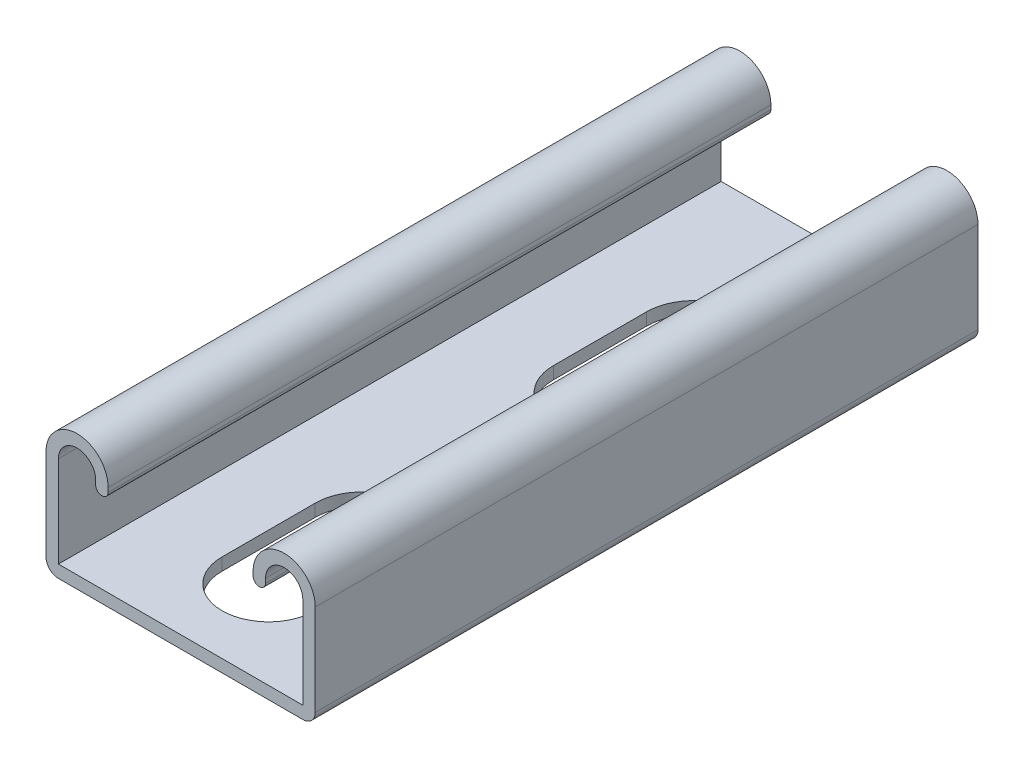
from build123d import *

# Parameters (mm, degrees)
BASE_EXTRUDE_DEPTH = 101.6
SLOT_DEPTH         = 114.827953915
LPATTERN1_COUNT    = 2
LPATTERN1_PITCH    = 50.8


with BuildPart() as part:
    # Sketch1 → Base-Extrude (new body)
    with BuildSketch(Plane.XY):
        with BuildLine():
            Line((-20.6375, 7.4295), (-20.6375, -6.5532))
            ThreePointArc((-20.6375, -6.5532), (-20.079538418, -7.900238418), (-18.7325, -8.4582))
            Line((-18.7325, -8.4582), (18.7325, -8.4582))
            ThreePointArc((18.7325, -8.4582), (20.079538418, -7.900238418), (20.6375, -6.5532))
            Line((20.6375, -6.5532), (20.6375, 7.4295))
            ThreePointArc((20.6375, 7.4295), (15.875, 12.192), (11.1125, 7.4295))
            Line((11.1125, 7.4295), (11.1125, 6.7945))
            ThreePointArc((11.1125, 6.7945), (12.065, 5.842), (13.0175, 6.7945))
            Line((13.0175, 6.7945), (13.0175, 7.4295))
            ThreePointArc((13.0175, 7.4295), (15.875, 10.287), (18.7325, 7.4295))
            Line((18.7325, 7.4295), (18.7325, -6.5532))
            Line((18.7325, -6.5532), (-18.7325, -6.5532))
            Line((-18.7325, -6.5532), (-18.7325, 7.4295))
            ThreePointArc((-18.7325, 7.4295), (-15.875, 10.287), (-13.0175, 7.4295))
            Line((-13.0175, 7.4295), (-13.0175, 6.7945))
            ThreePointArc((-13.0175, 6.7945), (-12.065, 5.842), (-11.1125, 6.7945))
            Line((-11.1125, 6.7945), (-11.1125, 7.4295))
            ThreePointArc((-11.1125, 7.4295), (-15.875, 12.192), (-20.6375, 7.4295))
        make_face()
    extrude(amount=BASE_EXTRUDE_DEPTH)

    # Sketch2 → Slot (cut, through all)
    with BuildSketch(Plane(origin=(-0.560706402, -8.4582, -8.313640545), x_dir=(1, 0, 0), z_dir=(0, -1, 0))):
        with BuildLine():
            Line((7.704456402, 45.619890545), (7.704456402, 31.332390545))
            ThreePointArc((7.704456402, 31.332390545), (0.560706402, 24.188640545), (-6.583043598, 31.332390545))
            Line((-6.583043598, 31.332390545), (-6.583043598, 45.619890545))
            ThreePointArc((-6.583043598, 45.619890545), (0.560706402, 52.763640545), (7.704456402, 45.619890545))
        make_face()
    slot = extrude(amount=-SLOT_DEPTH, mode=Mode.SUBTRACT)

    # LPattern1: Slot ×2
    with Locations(*[(0, 0, i * LPATTERN1_PITCH) for i in range(1, LPATTERN1_COUNT)]):
        add(slot, mode=Mode.SUBTRACT)


solid = part.part
